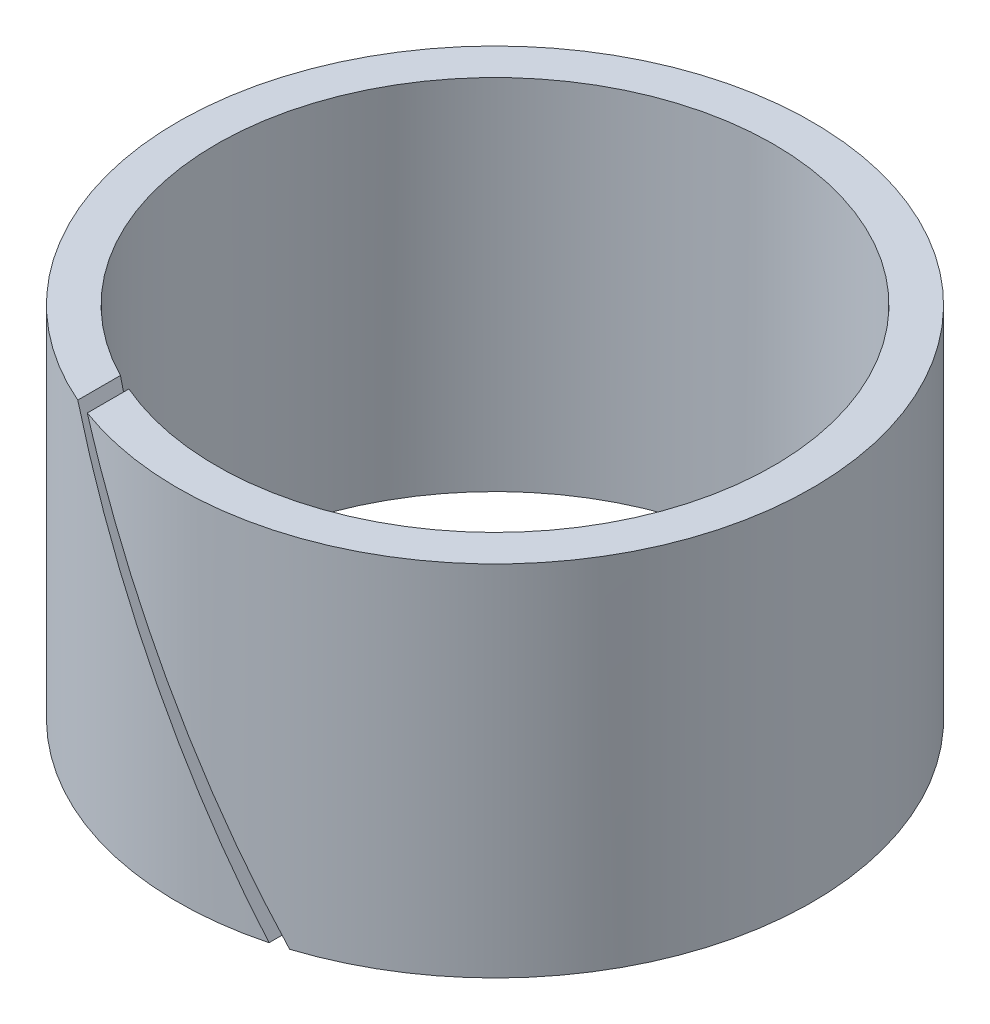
from build123d import *

# Parameters (mm, degrees)
SKETCH_2_W          = 1.4
SKETCH_2_H          = 13
CUT_EXTRUDE_1_DEPTH = 21.820662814


with BuildPart() as part:
    # Sketch 2 → Revolve 1 (revolve)
    with BuildSketch(Plane(origin=(0, 0, 0), x_dir=(0, 0, -1), z_dir=(1, 0, 0)), mode=Mode.PRIVATE) as revolve_1_sk:
        with Locations((10.8, -6.5)):
            Rectangle(SKETCH_2_W, SKETCH_2_H)
    revolve(revolve_1_sk.sketch.rotate(Axis((0, 6.908699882, 0), (0, -1, 0)), 180), axis=Axis((0, 6.908699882, 0), (0, -1, 0)))

    # Sketch 3 → Cut-Extrude 1 (cut, through all)
    with BuildSketch(Plane.XY):
        Polygon((-4.577350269, 0), (-4, 0), (3.505553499, -13), (2.92820323, -13), align=None)
    extrude(amount=CUT_EXTRUDE_1_DEPTH, mode=Mode.SUBTRACT)


solid = part.part
